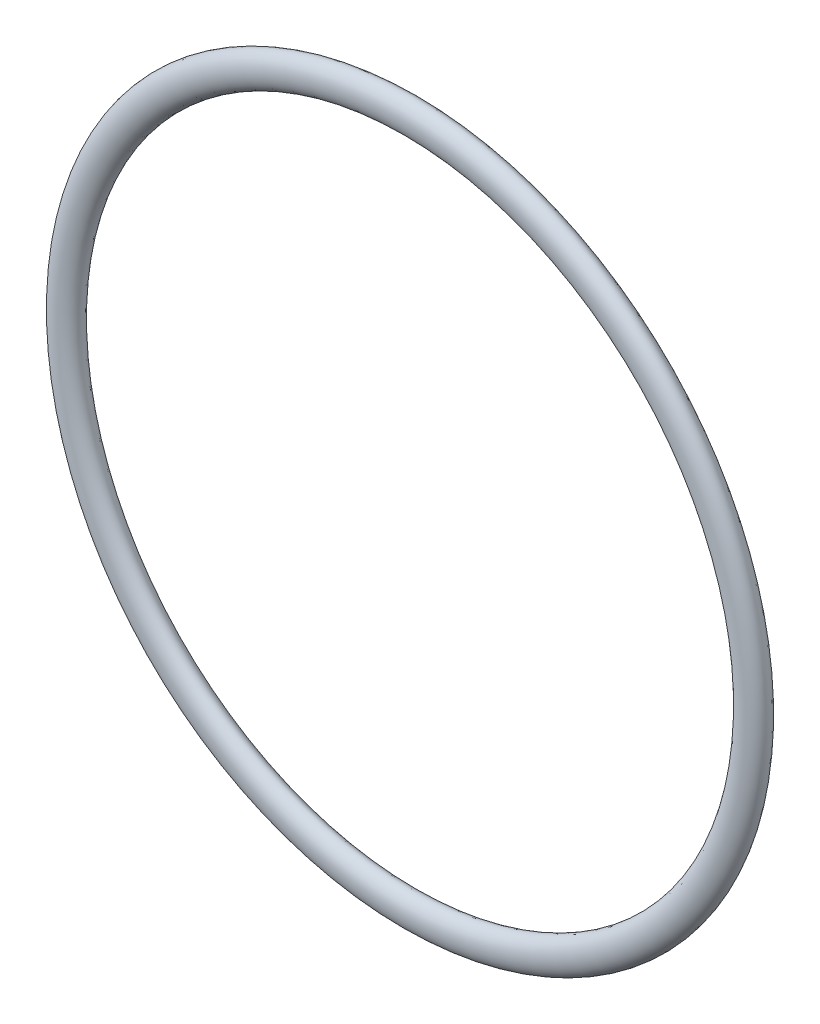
ISO-10303-21;
HEADER;
FILE_DESCRIPTION(('STEP AP214'),'2;1');
FILE_NAME('part.step','',(''),(''),'','','');
FILE_SCHEMA(('AUTOMOTIVE_DESIGN { 1 0 10303 214 1 1 1 1 }'));
ENDSEC;
DATA;
#1=APPLICATION_CONTEXT('core data for automotive mechanical design processes');
#2=APPLICATION_PROTOCOL_DEFINITION('international standard','automotive_design',2000,#1);
#3=PRODUCT_CONTEXT('',#1,'mechanical');
#4=PRODUCT('Part','Part','',(#3));
#5=PRODUCT_RELATED_PRODUCT_CATEGORY('part','',(#4));
#6=PRODUCT_DEFINITION_FORMATION('','',#4);
#7=PRODUCT_DEFINITION_CONTEXT('part definition',#1,'design');
#8=PRODUCT_DEFINITION('design','',#6,#7);
#9=PRODUCT_DEFINITION_SHAPE('','',#8);
#10=(LENGTH_UNIT() NAMED_UNIT(*) SI_UNIT(.MILLI.,.METRE.));
#11=(NAMED_UNIT(*) PLANE_ANGLE_UNIT() SI_UNIT($,.RADIAN.));
#12=(NAMED_UNIT(*) SI_UNIT($,.STERADIAN.) SOLID_ANGLE_UNIT());
#13=UNCERTAINTY_MEASURE_WITH_UNIT(LENGTH_MEASURE(1.E-05),#10,'distance_accuracy_value','');
#14=(GEOMETRIC_REPRESENTATION_CONTEXT(3) GLOBAL_UNCERTAINTY_ASSIGNED_CONTEXT((#13)) GLOBAL_UNIT_ASSIGNED_CONTEXT((#10,
#11,#12)) REPRESENTATION_CONTEXT('',''));
#15=CARTESIAN_POINT('',(0.,0.,0.));
#16=DIRECTION('',(0.,0.,1.));
#17=DIRECTION('',(1.,0.,0.));
#18=AXIS2_PLACEMENT_3D('',#15,#16,#17);
#19=CARTESIAN_POINT('',(0.,30.9,-1.));
#20=DIRECTION('',(1.,0.,0.));
#21=DIRECTION('',(0.,1.,0.));
#22=AXIS2_PLACEMENT_3D('',#19,#20,#21);
#23=ELLIPSE('',#22,1.5,1.);
#24=CARTESIAN_POINT('',(0.,0.,0.));
#25=DIRECTION('',(0.,0.,1.));
#26=AXIS1_PLACEMENT('',#24,#25);
#27=SURFACE_OF_REVOLUTION('',#23,#26);
#28=ADVANCED_FACE('F29',(),#27,.T.);
#29=CLOSED_SHELL('',(#28));
#30=MANIFOLD_SOLID_BREP('B2',#29);
#31=ADVANCED_BREP_SHAPE_REPRESENTATION('',(#18,#30),#14);
#32=SHAPE_DEFINITION_REPRESENTATION(#9,#31);
ENDSEC;
END-ISO-10303-21;
